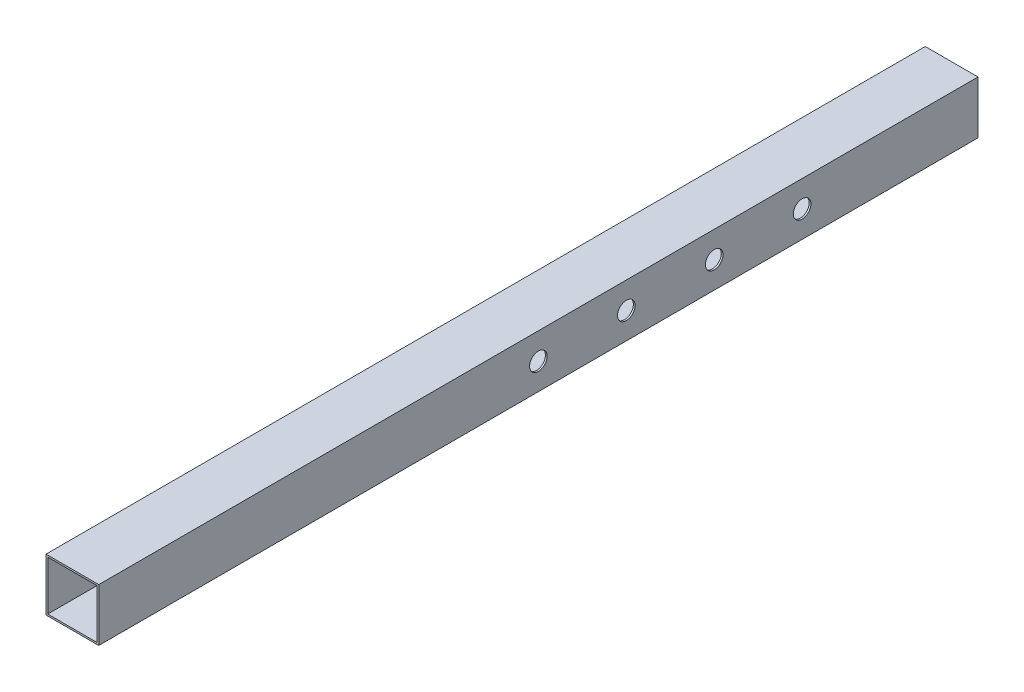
from build123d import *

# Parameters (mm, degrees)
SCHIZZO1_W                = 30
SCHIZZO1_H                = 30
SCHIZZO1_W_2              = 28
SCHIZZO1_H_2              = 28
ESTRUSIONE_SOTTILE1_DEPTH = 500
TAGLIO_ESTRUSIONE1_REACH  = 503.124
SCHIZZO2_R                = 5


with BuildPart() as part:
    # Schizzo1 → Estrusione-Sottile1 (new body)
    with BuildSketch(Plane.XY):
        Rectangle(SCHIZZO1_W, SCHIZZO1_H)
        Rectangle(SCHIZZO1_W_2, SCHIZZO1_H_2, mode=Mode.SUBTRACT)
    extrude(amount=ESTRUSIONE_SOTTILE1_DEPTH)

    # Taglio-Estrusione1: up to this face of the body (flat: up to its plane)
    taglio_estrusione1_end = Plane(part.part.faces().sort_by_distance((-15, 0, 250))[0])
    # Schizzo2 → Taglio-Estrusione1 (cut, up to the picked face)
    with BuildSketch(Plane(origin=(15, 0, 0), x_dir=(0, 0, -1), z_dir=(1, 0, 0)), mode=Mode.PRIVATE) as taglio_estrusione1_sk1:
        with Locations((-100, 0)):
            Circle(SCHIZZO2_R)
    taglio_estrusione1_tool1 = split(extrude(taglio_estrusione1_sk1.sketch, amount=-TAGLIO_ESTRUSIONE1_REACH, mode=Mode.PRIVATE), bisect_by=taglio_estrusione1_end, keep=Keep.BOTH, mode=Mode.PRIVATE)
    # Schizzo2 → Taglio-Estrusione1 (cut, up to the picked face)
    with BuildSketch(Plane(origin=(15, 0, 0), x_dir=(0, 0, -1), z_dir=(1, 0, 0)), mode=Mode.PRIVATE) as taglio_estrusione1_sk2:
        with Locations((-150, 0)):
            Circle(SCHIZZO2_R)
    taglio_estrusione1_tool2 = split(extrude(taglio_estrusione1_sk2.sketch, amount=-TAGLIO_ESTRUSIONE1_REACH, mode=Mode.PRIVATE), bisect_by=taglio_estrusione1_end, keep=Keep.BOTH, mode=Mode.PRIVATE)
    # Schizzo2 → Taglio-Estrusione1 (cut, up to the picked face)
    with BuildSketch(Plane(origin=(15, 0, 0), x_dir=(0, 0, -1), z_dir=(1, 0, 0)), mode=Mode.PRIVATE) as taglio_estrusione1_sk3:
        with Locations((-200, 0)):
            Circle(SCHIZZO2_R)
    taglio_estrusione1_tool3 = split(extrude(taglio_estrusione1_sk3.sketch, amount=-TAGLIO_ESTRUSIONE1_REACH, mode=Mode.PRIVATE), bisect_by=taglio_estrusione1_end, keep=Keep.BOTH, mode=Mode.PRIVATE)
    # Schizzo2 → Taglio-Estrusione1 (cut, up to the picked face)
    with BuildSketch(Plane(origin=(15, 0, 0), x_dir=(0, 0, -1), z_dir=(1, 0, 0)), mode=Mode.PRIVATE) as taglio_estrusione1_sk4:
        with Locations((-250, 0)):
            Circle(SCHIZZO2_R)
    taglio_estrusione1_tool4 = split(extrude(taglio_estrusione1_sk4.sketch, amount=-TAGLIO_ESTRUSIONE1_REACH, mode=Mode.PRIVATE), bisect_by=taglio_estrusione1_end, keep=Keep.BOTH, mode=Mode.PRIVATE)
    add(taglio_estrusione1_tool1.solids().sort_by(Axis((15, 0, 100), (-1, 0, 0)))[0], mode=Mode.SUBTRACT)
    add(taglio_estrusione1_tool2.solids().sort_by(Axis((15, 0, 150), (-1, 0, 0)))[0], mode=Mode.SUBTRACT)
    add(taglio_estrusione1_tool3.solids().sort_by(Axis((15, 0, 200), (-1, 0, 0)))[0], mode=Mode.SUBTRACT)
    add(taglio_estrusione1_tool4.solids().sort_by(Axis((15, 0, 250), (-1, 0, 0)))[0], mode=Mode.SUBTRACT)


solid = part.part
